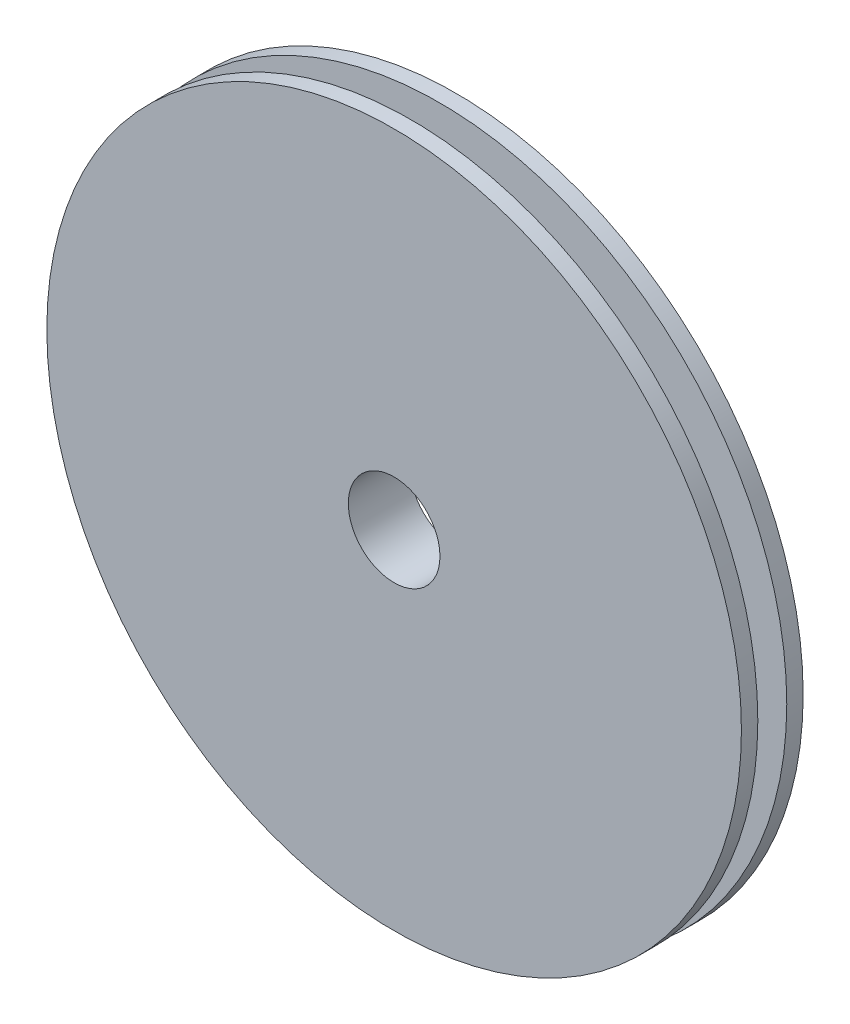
ISO-10303-21;
HEADER;
FILE_DESCRIPTION(('STEP AP214'),'2;1');
FILE_NAME('part.step','',(''),(''),'','','');
FILE_SCHEMA(('AUTOMOTIVE_DESIGN { 1 0 10303 214 1 1 1 1 }'));
ENDSEC;
DATA;
#1=APPLICATION_CONTEXT('core data for automotive mechanical design processes');
#2=APPLICATION_PROTOCOL_DEFINITION('international standard','automotive_design',2000,#1);
#3=PRODUCT_CONTEXT('',#1,'mechanical');
#4=PRODUCT('Part','Part','',(#3));
#5=PRODUCT_RELATED_PRODUCT_CATEGORY('part','',(#4));
#6=PRODUCT_DEFINITION_FORMATION('','',#4);
#7=PRODUCT_DEFINITION_CONTEXT('part definition',#1,'design');
#8=PRODUCT_DEFINITION('design','',#6,#7);
#9=PRODUCT_DEFINITION_SHAPE('','',#8);
#10=(LENGTH_UNIT() NAMED_UNIT(*) SI_UNIT(.MILLI.,.METRE.));
#11=(NAMED_UNIT(*) PLANE_ANGLE_UNIT() SI_UNIT($,.RADIAN.));
#12=(NAMED_UNIT(*) SI_UNIT($,.STERADIAN.) SOLID_ANGLE_UNIT());
#13=UNCERTAINTY_MEASURE_WITH_UNIT(LENGTH_MEASURE(1.E-05),#10,'distance_accuracy_value','');
#14=(GEOMETRIC_REPRESENTATION_CONTEXT(3) GLOBAL_UNCERTAINTY_ASSIGNED_CONTEXT((#13)) GLOBAL_UNIT_ASSIGNED_CONTEXT((#10,
#11,#12)) REPRESENTATION_CONTEXT('',''));
#15=CARTESIAN_POINT('',(0.,0.,0.));
#16=DIRECTION('',(0.,0.,1.));
#17=DIRECTION('',(1.,0.,0.));
#18=AXIS2_PLACEMENT_3D('',#15,#16,#17);
#19=CARTESIAN_POINT('',(0.,0.,3.2));
#20=DIRECTION('',(0.,0.,-1.));
#21=DIRECTION('',(-1.,0.,0.));
#22=AXIS2_PLACEMENT_3D('',#19,#20,#21);
#23=CYLINDRICAL_SURFACE('',#22,18.);
#24=CARTESIAN_POINT('',(0.,0.,0.));
#25=DIRECTION('',(0.,0.,1.));
#26=DIRECTION('',(1.,0.,0.));
#27=AXIS2_PLACEMENT_3D('',#24,#25,#26);
#28=CIRCLE('',#27,18.);
#29=CARTESIAN_POINT('',(18.,0.,0.));
#30=VERTEX_POINT('',#29);
#31=EDGE_CURVE('E52',#30,#30,#28,.T.);
#32=ORIENTED_EDGE('',*,*,#31,.T.);
#33=EDGE_LOOP('',(#32));
#34=FACE_BOUND('',#33,.T.);
#35=CARTESIAN_POINT('',(0.,0.,0.85));
#36=DIRECTION('',(0.,0.,1.));
#37=DIRECTION('',(1.,0.,0.));
#38=AXIS2_PLACEMENT_3D('',#35,#36,#37);
#39=CIRCLE('',#38,18.);
#40=CARTESIAN_POINT('',(18.,0.,0.85));
#41=VERTEX_POINT('',#40);
#42=EDGE_CURVE('E64',#41,#41,#39,.T.);
#43=ORIENTED_EDGE('',*,*,#42,.F.);
#44=EDGE_LOOP('',(#43));
#45=FACE_BOUND('',#44,.T.);
#46=ADVANCED_FACE('F44',(#34,#45),#23,.T.);
#47=CARTESIAN_POINT('',(0.,0.,2.35));
#48=DIRECTION('',(0.,0.,1.));
#49=DIRECTION('',(1.,0.,0.));
#50=AXIS2_PLACEMENT_3D('',#47,#48,#49);
#51=CIRCLE('',#50,18.);
#52=CARTESIAN_POINT('',(18.,0.,2.35));
#53=VERTEX_POINT('',#52);
#54=EDGE_CURVE('E61',#53,#53,#51,.T.);
#55=ORIENTED_EDGE('',*,*,#54,.T.);
#56=EDGE_LOOP('',(#55));
#57=FACE_BOUND('',#56,.T.);
#58=CARTESIAN_POINT('',(0.,0.,3.2));
#59=DIRECTION('',(0.,0.,1.));
#60=DIRECTION('',(1.,0.,0.));
#61=AXIS2_PLACEMENT_3D('',#58,#59,#60);
#62=CIRCLE('',#61,18.);
#63=CARTESIAN_POINT('',(18.,0.,3.2));
#64=VERTEX_POINT('',#63);
#65=EDGE_CURVE('E11',#64,#64,#62,.T.);
#66=ORIENTED_EDGE('',*,*,#65,.F.);
#67=EDGE_LOOP('',(#66));
#68=FACE_BOUND('',#67,.T.);
#69=ADVANCED_FACE('F46',(#57,#68),#23,.T.);
#70=CARTESIAN_POINT('',(0.,0.,3.2));
#71=DIRECTION('',(0.,0.,1.));
#72=DIRECTION('',(1.,0.,0.));
#73=AXIS2_PLACEMENT_3D('',#70,#71,#72);
#74=PLANE('',#73);
#75=CARTESIAN_POINT('',(0.,0.,3.2));
#76=DIRECTION('',(0.,0.,1.));
#77=DIRECTION('',(1.,0.,0.));
#78=AXIS2_PLACEMENT_3D('',#75,#76,#77);
#79=CIRCLE('',#78,2.375);
#80=CARTESIAN_POINT('',(2.375,0.,3.2));
#81=VERTEX_POINT('',#80);
#82=EDGE_CURVE('E57',#81,#81,#79,.F.);
#83=ORIENTED_EDGE('',*,*,#82,.T.);
#84=EDGE_LOOP('',(#83));
#85=FACE_BOUND('',#84,.T.);
#86=ORIENTED_EDGE('',*,*,#65,.T.);
#87=EDGE_LOOP('',(#86));
#88=FACE_BOUND('',#87,.T.);
#89=ADVANCED_FACE('F90',(#85,#88),#74,.T.);
#90=CARTESIAN_POINT('',(0.,0.,0.));
#91=DIRECTION('',(0.,0.,1.));
#92=DIRECTION('',(1.,0.,0.));
#93=AXIS2_PLACEMENT_3D('',#90,#91,#92);
#94=PLANE('',#93);
#95=CARTESIAN_POINT('',(0.,0.,0.));
#96=DIRECTION('',(0.,0.,1.));
#97=DIRECTION('',(1.,0.,0.));
#98=AXIS2_PLACEMENT_3D('',#95,#96,#97);
#99=CIRCLE('',#98,2.375);
#100=CARTESIAN_POINT('',(2.375,0.,0.));
#101=VERTEX_POINT('',#100);
#102=EDGE_CURVE('E48',#101,#101,#99,.F.);
#103=ORIENTED_EDGE('',*,*,#102,.F.);
#104=EDGE_LOOP('',(#103));
#105=FACE_BOUND('',#104,.T.);
#106=ORIENTED_EDGE('',*,*,#31,.F.);
#107=EDGE_LOOP('',(#106));
#108=FACE_BOUND('',#107,.T.);
#109=ADVANCED_FACE('F94',(#105,#108),#94,.F.);
#110=CARTESIAN_POINT('',(0.,0.,20.2));
#111=DIRECTION('',(0.,0.,-1.));
#112=DIRECTION('',(-1.,0.,0.));
#113=AXIS2_PLACEMENT_3D('',#110,#111,#112);
#114=CYLINDRICAL_SURFACE('',#113,2.375);
#115=ORIENTED_EDGE('',*,*,#82,.F.);
#116=EDGE_LOOP('',(#115));
#117=FACE_BOUND('',#116,.T.);
#118=ORIENTED_EDGE('',*,*,#102,.T.);
#119=EDGE_LOOP('',(#118));
#120=FACE_BOUND('',#119,.T.);
#121=ADVANCED_FACE('F81',(#117,#120),#114,.F.);
#122=CARTESIAN_POINT('',(0.,0.,0.85));
#123=DIRECTION('',(0.,0.,1.));
#124=DIRECTION('',(1.,0.,0.));
#125=AXIS2_PLACEMENT_3D('',#122,#123,#124);
#126=PLANE('',#125);
#127=CARTESIAN_POINT('',(0.,0.,0.85));
#128=DIRECTION('',(0.,0.,1.));
#129=DIRECTION('',(1.,0.,0.));
#130=AXIS2_PLACEMENT_3D('',#127,#128,#129);
#131=CIRCLE('',#130,15.5);
#132=CARTESIAN_POINT('',(15.5,0.,0.85));
#133=VERTEX_POINT('',#132);
#134=EDGE_CURVE('E65',#133,#133,#131,.T.);
#135=ORIENTED_EDGE('',*,*,#134,.F.);
#136=EDGE_LOOP('',(#135));
#137=FACE_BOUND('',#136,.T.);
#138=ORIENTED_EDGE('',*,*,#42,.T.);
#139=EDGE_LOOP('',(#138));
#140=FACE_BOUND('',#139,.T.);
#141=ADVANCED_FACE('F77',(#137,#140),#126,.T.);
#142=CARTESIAN_POINT('',(0.,0.,2.35));
#143=DIRECTION('',(0.,0.,1.));
#144=DIRECTION('',(1.,0.,0.));
#145=AXIS2_PLACEMENT_3D('',#142,#143,#144);
#146=PLANE('',#145);
#147=CARTESIAN_POINT('',(0.,0.,2.35));
#148=DIRECTION('',(0.,0.,1.));
#149=DIRECTION('',(1.,0.,0.));
#150=AXIS2_PLACEMENT_3D('',#147,#148,#149);
#151=CIRCLE('',#150,15.5);
#152=CARTESIAN_POINT('',(15.5,0.,2.35));
#153=VERTEX_POINT('',#152);
#154=EDGE_CURVE('E68',#153,#153,#151,.T.);
#155=ORIENTED_EDGE('',*,*,#154,.T.);
#156=EDGE_LOOP('',(#155));
#157=FACE_BOUND('',#156,.T.);
#158=ORIENTED_EDGE('',*,*,#54,.F.);
#159=EDGE_LOOP('',(#158));
#160=FACE_BOUND('',#159,.T.);
#161=ADVANCED_FACE('F80',(#157,#160),#146,.F.);
#162=CARTESIAN_POINT('',(0.,0.,0.85));
#163=DIRECTION('',(0.,0.,1.));
#164=DIRECTION('',(1.,0.,0.));
#165=AXIS2_PLACEMENT_3D('',#162,#163,#164);
#166=CYLINDRICAL_SURFACE('',#165,15.5);
#167=ORIENTED_EDGE('',*,*,#134,.T.);
#168=EDGE_LOOP('',(#167));
#169=FACE_BOUND('',#168,.T.);
#170=ORIENTED_EDGE('',*,*,#154,.F.);
#171=EDGE_LOOP('',(#170));
#172=FACE_BOUND('',#171,.T.);
#173=ADVANCED_FACE('F74',(#169,#172),#166,.T.);
#174=CLOSED_SHELL('',(#46,#69,#89,#109,#121,#141,#161,#173));
#175=MANIFOLD_SOLID_BREP('B2',#174);
#176=ADVANCED_BREP_SHAPE_REPRESENTATION('',(#18,#175),#14);
#177=SHAPE_DEFINITION_REPRESENTATION(#9,#176);
ENDSEC;
END-ISO-10303-21;
